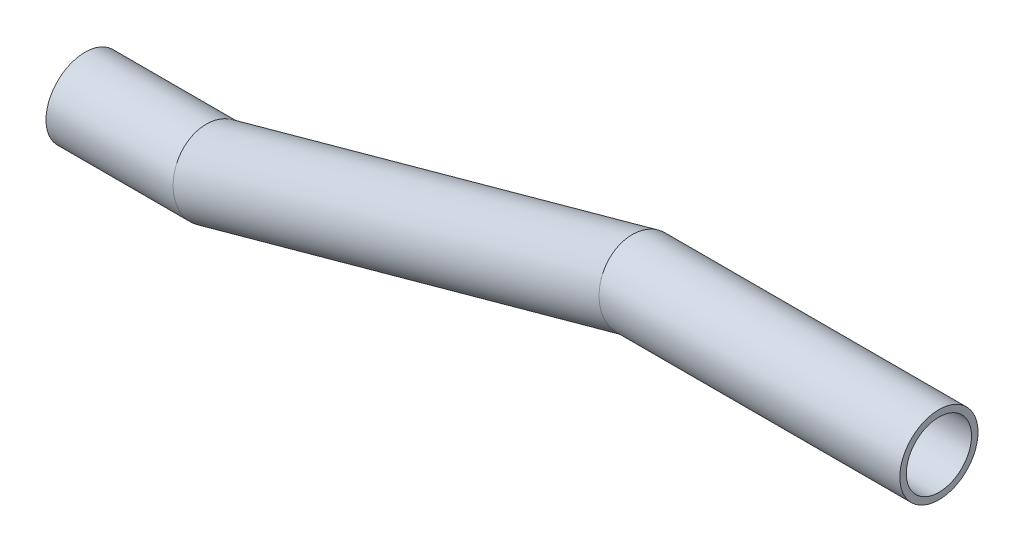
from build123d import *

# Parameters (mm, degrees)
SKIZZE6_R   = 30.15
SKIZZE6_R_2 = 25.15


with BuildPart() as part:
    # Austragung1: sweep along a curve in space
    with BuildLine() as austragung1_path:
        Line((0, 0, 0), (-230, 0, 0))
        Line((-230, 0, 0), (-597, -129, -38.5))
        Line((-597, -129, -38.5), (-697, -129, -38.5))
    # Skizze6 → Austragung1 (sweep)
    with BuildSketch(Plane(origin=(0, 0, 0), x_dir=(0, 0, -1), z_dir=(1, 0, 0))):
        Circle(SKIZZE6_R)
        Circle(SKIZZE6_R_2, mode=Mode.SUBTRACT)
    sweep(path=austragung1_path.line, transition=Transition.RIGHT)


solid = part.part
